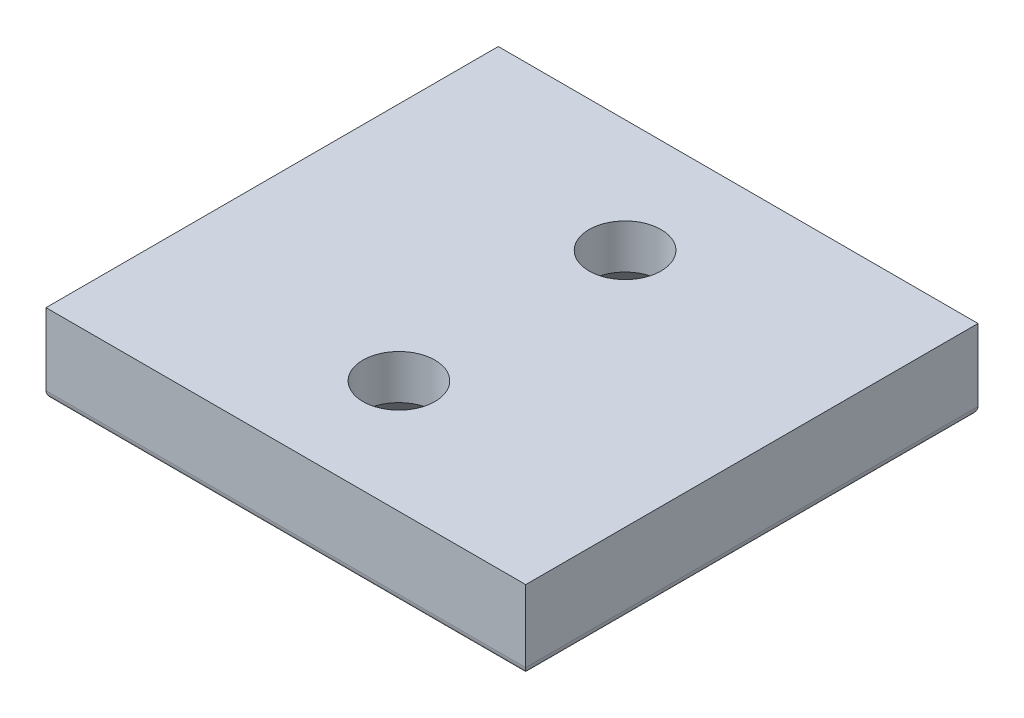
ISO-10303-21;
HEADER;
FILE_DESCRIPTION(('STEP AP214'),'2;1');
FILE_NAME('part.step','',(''),(''),'','','');
FILE_SCHEMA(('AUTOMOTIVE_DESIGN { 1 0 10303 214 1 1 1 1 }'));
ENDSEC;
DATA;
#1=APPLICATION_CONTEXT('core data for automotive mechanical design processes');
#2=APPLICATION_PROTOCOL_DEFINITION('international standard','automotive_design',2000,#1);
#3=PRODUCT_CONTEXT('',#1,'mechanical');
#4=PRODUCT('Part','Part','',(#3));
#5=PRODUCT_RELATED_PRODUCT_CATEGORY('part','',(#4));
#6=PRODUCT_DEFINITION_FORMATION('','',#4);
#7=PRODUCT_DEFINITION_CONTEXT('part definition',#1,'design');
#8=PRODUCT_DEFINITION('design','',#6,#7);
#9=PRODUCT_DEFINITION_SHAPE('','',#8);
#10=(LENGTH_UNIT() NAMED_UNIT(*) SI_UNIT(.MILLI.,.METRE.));
#11=(NAMED_UNIT(*) PLANE_ANGLE_UNIT() SI_UNIT($,.RADIAN.));
#12=(NAMED_UNIT(*) SI_UNIT($,.STERADIAN.) SOLID_ANGLE_UNIT());
#13=UNCERTAINTY_MEASURE_WITH_UNIT(LENGTH_MEASURE(1.E-05),#10,'distance_accuracy_value','');
#14=(GEOMETRIC_REPRESENTATION_CONTEXT(3) GLOBAL_UNCERTAINTY_ASSIGNED_CONTEXT((#13)) GLOBAL_UNIT_ASSIGNED_CONTEXT((#10,
#11,#12)) REPRESENTATION_CONTEXT('',''));
#15=CARTESIAN_POINT('',(0.,0.,0.));
#16=DIRECTION('',(0.,0.,1.));
#17=DIRECTION('',(1.,0.,0.));
#18=AXIS2_PLACEMENT_3D('',#15,#16,#17);
#19=CARTESIAN_POINT('',(30.,10.,28.285));
#20=DIRECTION('',(-1.,0.,0.));
#21=DIRECTION('',(0.,0.,1.));
#22=AXIS2_PLACEMENT_3D('',#19,#20,#21);
#23=PLANE('',#22);
#24=DIRECTION('',(0.,-1.,0.));
#25=VECTOR('',#24,1.);
#26=CARTESIAN_POINT('',(30.,10.,28.285));
#27=LINE('',#26,#25);
#28=CARTESIAN_POINT('',(30.,10.,28.285));
#29=VERTEX_POINT('',#28);
#30=CARTESIAN_POINT('',(30.,0.999999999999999,28.285));
#31=VERTEX_POINT('',#30);
#32=EDGE_CURVE('E153',#29,#31,#27,.T.);
#33=ORIENTED_EDGE('',*,*,#32,.T.);
#34=DIRECTION('',(0.,0.,-1.));
#35=VECTOR('',#34,1.);
#36=CARTESIAN_POINT('',(30.,0.999999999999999,-28.285));
#37=LINE('',#36,#35);
#38=CARTESIAN_POINT('',(30.,0.999999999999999,-28.285));
#39=VERTEX_POINT('',#38);
#40=EDGE_CURVE('E11',#31,#39,#37,.T.);
#41=ORIENTED_EDGE('',*,*,#40,.T.);
#42=DIRECTION('',(0.,-1.,0.));
#43=VECTOR('',#42,1.);
#44=CARTESIAN_POINT('',(30.,10.,-28.285));
#45=LINE('',#44,#43);
#46=CARTESIAN_POINT('',(30.,10.,-28.285));
#47=VERTEX_POINT('',#46);
#48=EDGE_CURVE('E94',#47,#39,#45,.T.);
#49=ORIENTED_EDGE('',*,*,#48,.F.);
#50=DIRECTION('',(0.,0.,-1.));
#51=VECTOR('',#50,1.);
#52=CARTESIAN_POINT('',(30.,10.,28.285));
#53=LINE('',#52,#51);
#54=EDGE_CURVE('E100',#29,#47,#53,.T.);
#55=ORIENTED_EDGE('',*,*,#54,.F.);
#56=EDGE_LOOP('',(#33,#41,#49,#55));
#57=FACE_BOUND('',#56,.T.);
#58=ADVANCED_FACE('F33',(#57),#23,.F.);
#59=CARTESIAN_POINT('',(-30.,10.,-28.285));
#60=DIRECTION('',(0.,0.,1.));
#61=DIRECTION('',(1.,0.,0.));
#62=AXIS2_PLACEMENT_3D('',#59,#60,#61);
#63=PLANE('',#62);
#64=ORIENTED_EDGE('',*,*,#48,.T.);
#65=DIRECTION('',(-1.,0.,0.));
#66=VECTOR('',#65,1.);
#67=CARTESIAN_POINT('',(-30.,0.999999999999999,-28.285));
#68=LINE('',#67,#66);
#69=CARTESIAN_POINT('',(-30.,0.999999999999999,-28.285));
#70=VERTEX_POINT('',#69);
#71=EDGE_CURVE('E109',#39,#70,#68,.T.);
#72=ORIENTED_EDGE('',*,*,#71,.T.);
#73=DIRECTION('',(0.,-1.,0.));
#74=VECTOR('',#73,1.);
#75=CARTESIAN_POINT('',(-30.,10.,-28.285));
#76=LINE('',#75,#74);
#77=CARTESIAN_POINT('',(-30.,10.,-28.285));
#78=VERTEX_POINT('',#77);
#79=EDGE_CURVE('E96',#78,#70,#76,.T.);
#80=ORIENTED_EDGE('',*,*,#79,.F.);
#81=DIRECTION('',(-1.,0.,0.));
#82=VECTOR('',#81,1.);
#83=CARTESIAN_POINT('',(-30.,10.,-28.285));
#84=LINE('',#83,#82);
#85=EDGE_CURVE('E89',#47,#78,#84,.T.);
#86=ORIENTED_EDGE('',*,*,#85,.F.);
#87=EDGE_LOOP('',(#64,#72,#80,#86));
#88=FACE_BOUND('',#87,.T.);
#89=ADVANCED_FACE('F91',(#88),#63,.F.);
#90=CARTESIAN_POINT('',(-30.,10.,28.285));
#91=DIRECTION('',(1.,0.,0.));
#92=DIRECTION('',(0.,0.,-1.));
#93=AXIS2_PLACEMENT_3D('',#90,#91,#92);
#94=PLANE('',#93);
#95=ORIENTED_EDGE('',*,*,#79,.T.);
#96=DIRECTION('',(0.,0.,1.));
#97=VECTOR('',#96,1.);
#98=CARTESIAN_POINT('',(-30.,0.999999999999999,28.285));
#99=LINE('',#98,#97);
#100=CARTESIAN_POINT('',(-30.,0.999999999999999,28.285));
#101=VERTEX_POINT('',#100);
#102=EDGE_CURVE('E57',#70,#101,#99,.T.);
#103=ORIENTED_EDGE('',*,*,#102,.T.);
#104=DIRECTION('',(0.,-1.,0.));
#105=VECTOR('',#104,1.);
#106=CARTESIAN_POINT('',(-30.,10.,28.285));
#107=LINE('',#106,#105);
#108=CARTESIAN_POINT('',(-30.,10.,28.285));
#109=VERTEX_POINT('',#108);
#110=EDGE_CURVE('E113',#109,#101,#107,.T.);
#111=ORIENTED_EDGE('',*,*,#110,.F.);
#112=DIRECTION('',(0.,0.,1.));
#113=VECTOR('',#112,1.);
#114=CARTESIAN_POINT('',(-30.,10.,28.285));
#115=LINE('',#114,#113);
#116=EDGE_CURVE('E99',#78,#109,#115,.T.);
#117=ORIENTED_EDGE('',*,*,#116,.F.);
#118=EDGE_LOOP('',(#95,#103,#111,#117));
#119=FACE_BOUND('',#118,.T.);
#120=ADVANCED_FACE('F151',(#119),#94,.F.);
#121=CARTESIAN_POINT('',(-30.,10.,28.285));
#122=DIRECTION('',(0.,0.,-1.));
#123=DIRECTION('',(-1.,0.,0.));
#124=AXIS2_PLACEMENT_3D('',#121,#122,#123);
#125=PLANE('',#124);
#126=ORIENTED_EDGE('',*,*,#110,.T.);
#127=DIRECTION('',(1.,0.,0.));
#128=VECTOR('',#127,1.);
#129=CARTESIAN_POINT('',(30.,0.999999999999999,28.285));
#130=LINE('',#129,#128);
#131=EDGE_CURVE('E42',#101,#31,#130,.T.);
#132=ORIENTED_EDGE('',*,*,#131,.T.);
#133=ORIENTED_EDGE('',*,*,#32,.F.);
#134=DIRECTION('',(1.,0.,0.));
#135=VECTOR('',#134,1.);
#136=CARTESIAN_POINT('',(-30.,10.,28.285));
#137=LINE('',#136,#135);
#138=EDGE_CURVE('E105',#109,#29,#137,.T.);
#139=ORIENTED_EDGE('',*,*,#138,.F.);
#140=EDGE_LOOP('',(#126,#132,#133,#139));
#141=FACE_BOUND('',#140,.T.);
#142=ADVANCED_FACE('F156',(#141),#125,.F.);
#143=CARTESIAN_POINT('',(0.,10.,0.));
#144=DIRECTION('',(0.,-1.,0.));
#145=DIRECTION('',(0.,0.,-1.));
#146=AXIS2_PLACEMENT_3D('',#143,#144,#145);
#147=PLANE('',#146);
#148=CARTESIAN_POINT('',(0.,10.,14.1425));
#149=DIRECTION('',(0.,-1.,0.));
#150=DIRECTION('',(0.,0.,-1.));
#151=AXIS2_PLACEMENT_3D('',#148,#149,#150);
#152=CIRCLE('',#151,4.5);
#153=CARTESIAN_POINT('',(0.,10.,9.6425));
#154=VERTEX_POINT('',#153);
#155=EDGE_CURVE('E214',#154,#154,#152,.T.);
#156=ORIENTED_EDGE('',*,*,#155,.T.);
#157=EDGE_LOOP('',(#156));
#158=FACE_BOUND('',#157,.T.);
#159=CARTESIAN_POINT('',(0.,10.,-14.1425));
#160=DIRECTION('',(0.,-1.,0.));
#161=DIRECTION('',(0.,0.,-1.));
#162=AXIS2_PLACEMENT_3D('',#159,#160,#161);
#163=CIRCLE('',#162,4.5);
#164=CARTESIAN_POINT('',(0.,10.,-18.6425));
#165=VERTEX_POINT('',#164);
#166=EDGE_CURVE('E130',#165,#165,#163,.T.);
#167=ORIENTED_EDGE('',*,*,#166,.T.);
#168=EDGE_LOOP('',(#167));
#169=FACE_BOUND('',#168,.T.);
#170=ORIENTED_EDGE('',*,*,#54,.T.);
#171=ORIENTED_EDGE('',*,*,#85,.T.);
#172=ORIENTED_EDGE('',*,*,#116,.T.);
#173=ORIENTED_EDGE('',*,*,#138,.T.);
#174=EDGE_LOOP('',(#170,#171,#172,#173));
#175=FACE_BOUND('',#174,.T.);
#176=ADVANCED_FACE('F103',(#158,#169,#175),#147,.F.);
#177=CARTESIAN_POINT('',(0.,0.,0.));
#178=DIRECTION('',(0.,-1.,0.));
#179=DIRECTION('',(0.,0.,-1.));
#180=AXIS2_PLACEMENT_3D('',#177,#178,#179);
#181=PLANE('',#180);
#182=CARTESIAN_POINT('',(0.,0.,14.1425));
#183=DIRECTION('',(0.,-1.,0.));
#184=DIRECTION('',(0.,0.,-1.));
#185=AXIS2_PLACEMENT_3D('',#182,#183,#184);
#186=CIRCLE('',#185,8.96);
#187=CARTESIAN_POINT('',(0.,0.,5.18249999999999));
#188=VERTEX_POINT('',#187);
#189=EDGE_CURVE('E212',#188,#188,#186,.T.);
#190=ORIENTED_EDGE('',*,*,#189,.F.);
#191=EDGE_LOOP('',(#190));
#192=FACE_BOUND('',#191,.T.);
#193=CARTESIAN_POINT('',(0.,0.,-14.1425));
#194=DIRECTION('',(0.,-1.,0.));
#195=DIRECTION('',(0.,0.,-1.));
#196=AXIS2_PLACEMENT_3D('',#193,#194,#195);
#197=CIRCLE('',#196,8.96);
#198=CARTESIAN_POINT('',(0.,0.,-23.1025));
#199=VERTEX_POINT('',#198);
#200=EDGE_CURVE('E219',#199,#199,#197,.T.);
#201=ORIENTED_EDGE('',*,*,#200,.F.);
#202=EDGE_LOOP('',(#201));
#203=FACE_BOUND('',#202,.T.);
#204=DIRECTION('',(0.,0.,1.));
#205=VECTOR('',#204,1.);
#206=CARTESIAN_POINT('',(-29.,0.,-28.285));
#207=LINE('',#206,#205);
#208=CARTESIAN_POINT('',(-29.,0.,27.285));
#209=VERTEX_POINT('',#208);
#210=CARTESIAN_POINT('',(-29.,0.,-27.285));
#211=VERTEX_POINT('',#210);
#212=EDGE_CURVE('E120',#209,#211,#207,.F.);
#213=ORIENTED_EDGE('',*,*,#212,.T.);
#214=DIRECTION('',(-1.,0.,0.));
#215=VECTOR('',#214,1.);
#216=CARTESIAN_POINT('',(30.,0.,-27.285));
#217=LINE('',#216,#215);
#218=CARTESIAN_POINT('',(29.,0.,-27.285));
#219=VERTEX_POINT('',#218);
#220=EDGE_CURVE('E122',#211,#219,#217,.F.);
#221=ORIENTED_EDGE('',*,*,#220,.T.);
#222=DIRECTION('',(0.,0.,-1.));
#223=VECTOR('',#222,1.);
#224=CARTESIAN_POINT('',(29.,0.,28.285));
#225=LINE('',#224,#223);
#226=CARTESIAN_POINT('',(29.,0.,27.285));
#227=VERTEX_POINT('',#226);
#228=EDGE_CURVE('E111',#219,#227,#225,.F.);
#229=ORIENTED_EDGE('',*,*,#228,.T.);
#230=DIRECTION('',(1.,0.,0.));
#231=VECTOR('',#230,1.);
#232=CARTESIAN_POINT('',(-30.,0.,27.285));
#233=LINE('',#232,#231);
#234=EDGE_CURVE('E118',#227,#209,#233,.F.);
#235=ORIENTED_EDGE('',*,*,#234,.T.);
#236=EDGE_LOOP('',(#213,#221,#229,#235));
#237=FACE_BOUND('',#236,.T.);
#238=ADVANCED_FACE('F144',(#192,#203,#237),#181,.T.);
#239=CARTESIAN_POINT('',(-30.,0.999999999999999,27.285));
#240=DIRECTION('',(-1.,0.,0.));
#241=DIRECTION('',(0.,0.,1.));
#242=AXIS2_PLACEMENT_3D('',#239,#240,#241);
#243=CYLINDRICAL_SURFACE('',#242,1.);
#244=CARTESIAN_POINT('',(-29.,0.999999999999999,27.285));
#245=DIRECTION('',(-0.707106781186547,0.,-0.707106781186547));
#246=DIRECTION('',(-0.707106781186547,0.,0.707106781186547));
#247=AXIS2_PLACEMENT_3D('',#244,#245,#246);
#248=ELLIPSE('',#247,1.41421356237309,1.);
#249=EDGE_CURVE('E131',#209,#101,#248,.T.);
#250=ORIENTED_EDGE('',*,*,#249,.F.);
#251=ORIENTED_EDGE('',*,*,#234,.F.);
#252=CARTESIAN_POINT('',(29.,0.999999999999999,27.285));
#253=DIRECTION('',(-0.707106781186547,0.,0.707106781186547));
#254=DIRECTION('',(0.707106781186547,0.,0.707106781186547));
#255=AXIS2_PLACEMENT_3D('',#252,#253,#254);
#256=ELLIPSE('',#255,1.41421356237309,1.);
#257=EDGE_CURVE('E37',#31,#227,#256,.F.);
#258=ORIENTED_EDGE('',*,*,#257,.F.);
#259=ORIENTED_EDGE('',*,*,#131,.F.);
#260=EDGE_LOOP('',(#250,#251,#258,#259));
#261=FACE_BOUND('',#260,.T.);
#262=ADVANCED_FACE('F35',(#261),#243,.T.);
#263=CARTESIAN_POINT('',(29.,0.999999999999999,28.285));
#264=DIRECTION('',(0.,0.,1.));
#265=DIRECTION('',(1.,0.,0.));
#266=AXIS2_PLACEMENT_3D('',#263,#264,#265);
#267=CYLINDRICAL_SURFACE('',#266,1.);
#268=ORIENTED_EDGE('',*,*,#257,.T.);
#269=ORIENTED_EDGE('',*,*,#228,.F.);
#270=CARTESIAN_POINT('',(29.,0.999999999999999,-27.285));
#271=DIRECTION('',(0.707106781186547,0.,0.707106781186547));
#272=DIRECTION('',(-0.707106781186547,0.,0.707106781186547));
#273=AXIS2_PLACEMENT_3D('',#270,#271,#272);
#274=ELLIPSE('',#273,1.41421356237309,1.);
#275=EDGE_CURVE('E129',#39,#219,#274,.F.);
#276=ORIENTED_EDGE('',*,*,#275,.F.);
#277=ORIENTED_EDGE('',*,*,#40,.F.);
#278=EDGE_LOOP('',(#268,#269,#276,#277));
#279=FACE_BOUND('',#278,.T.);
#280=ADVANCED_FACE('F140',(#279),#267,.T.);
#281=CARTESIAN_POINT('',(-29.,0.999999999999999,28.285));
#282=DIRECTION('',(0.,0.,-1.));
#283=DIRECTION('',(-1.,0.,0.));
#284=AXIS2_PLACEMENT_3D('',#281,#282,#283);
#285=CYLINDRICAL_SURFACE('',#284,1.);
#286=ORIENTED_EDGE('',*,*,#249,.T.);
#287=ORIENTED_EDGE('',*,*,#102,.F.);
#288=CARTESIAN_POINT('',(-29.,0.999999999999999,-27.285));
#289=DIRECTION('',(0.707106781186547,0.,-0.707106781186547));
#290=DIRECTION('',(-0.707106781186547,0.,-0.707106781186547));
#291=AXIS2_PLACEMENT_3D('',#288,#289,#290);
#292=ELLIPSE('',#291,1.41421356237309,1.);
#293=EDGE_CURVE('E127',#211,#70,#292,.T.);
#294=ORIENTED_EDGE('',*,*,#293,.F.);
#295=ORIENTED_EDGE('',*,*,#212,.F.);
#296=EDGE_LOOP('',(#286,#287,#294,#295));
#297=FACE_BOUND('',#296,.T.);
#298=ADVANCED_FACE('F150',(#297),#285,.T.);
#299=CARTESIAN_POINT('',(-30.,0.999999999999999,-27.285));
#300=DIRECTION('',(1.,0.,0.));
#301=DIRECTION('',(0.,0.,-1.));
#302=AXIS2_PLACEMENT_3D('',#299,#300,#301);
#303=CYLINDRICAL_SURFACE('',#302,1.);
#304=ORIENTED_EDGE('',*,*,#275,.T.);
#305=ORIENTED_EDGE('',*,*,#220,.F.);
#306=ORIENTED_EDGE('',*,*,#293,.T.);
#307=ORIENTED_EDGE('',*,*,#71,.F.);
#308=EDGE_LOOP('',(#304,#305,#306,#307));
#309=FACE_BOUND('',#308,.T.);
#310=ADVANCED_FACE('F148',(#309),#303,.T.);
#311=CARTESIAN_POINT('',(0.,0.,-14.1425));
#312=DIRECTION('',(0.,-1.,0.));
#313=DIRECTION('',(0.,0.,-1.));
#314=AXIS2_PLACEMENT_3D('',#311,#312,#313);
#315=CYLINDRICAL_SURFACE('',#314,4.49999999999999);
#316=ORIENTED_EDGE('',*,*,#166,.F.);
#317=EDGE_LOOP('',(#316));
#318=FACE_BOUND('',#317,.T.);
#319=CARTESIAN_POINT('',(0.,4.45999999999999,-14.1425));
#320=DIRECTION('',(0.,-1.,0.));
#321=DIRECTION('',(0.,0.,-1.));
#322=AXIS2_PLACEMENT_3D('',#319,#320,#321);
#323=CIRCLE('',#322,4.49999999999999);
#324=CARTESIAN_POINT('',(0.,4.45999999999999,-18.6425));
#325=VERTEX_POINT('',#324);
#326=EDGE_CURVE('E222',#325,#325,#323,.T.);
#327=ORIENTED_EDGE('',*,*,#326,.T.);
#328=EDGE_LOOP('',(#327));
#329=FACE_BOUND('',#328,.T.);
#330=ADVANCED_FACE('F176',(#318,#329),#315,.F.);
#331=CARTESIAN_POINT('',(0.,0.,-14.1425));
#332=DIRECTION('',(0.,-1.,0.));
#333=DIRECTION('',(0.,0.,-1.));
#334=AXIS2_PLACEMENT_3D('',#331,#332,#333);
#335=CONICAL_SURFACE('',#334,8.96,0.78539816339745);
#336=ORIENTED_EDGE('',*,*,#326,.F.);
#337=EDGE_LOOP('',(#336));
#338=FACE_BOUND('',#337,.T.);
#339=ORIENTED_EDGE('',*,*,#200,.T.);
#340=EDGE_LOOP('',(#339));
#341=FACE_BOUND('',#340,.T.);
#342=ADVANCED_FACE('F193',(#338,#341),#335,.F.);
#343=CARTESIAN_POINT('',(0.,0.,14.1425));
#344=DIRECTION('',(0.,-1.,0.));
#345=DIRECTION('',(0.,0.,-1.));
#346=AXIS2_PLACEMENT_3D('',#343,#344,#345);
#347=CYLINDRICAL_SURFACE('',#346,4.49999999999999);
#348=ORIENTED_EDGE('',*,*,#155,.F.);
#349=EDGE_LOOP('',(#348));
#350=FACE_BOUND('',#349,.T.);
#351=CARTESIAN_POINT('',(0.,4.45999999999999,14.1425));
#352=DIRECTION('',(0.,-1.,0.));
#353=DIRECTION('',(0.,0.,-1.));
#354=AXIS2_PLACEMENT_3D('',#351,#352,#353);
#355=CIRCLE('',#354,4.49999999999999);
#356=CARTESIAN_POINT('',(0.,4.45999999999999,9.64250000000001));
#357=VERTEX_POINT('',#356);
#358=EDGE_CURVE('E210',#357,#357,#355,.T.);
#359=ORIENTED_EDGE('',*,*,#358,.T.);
#360=EDGE_LOOP('',(#359));
#361=FACE_BOUND('',#360,.T.);
#362=ADVANCED_FACE('F197',(#350,#361),#347,.F.);
#363=CARTESIAN_POINT('',(0.,0.,14.1425));
#364=DIRECTION('',(0.,-1.,0.));
#365=DIRECTION('',(0.,0.,-1.));
#366=AXIS2_PLACEMENT_3D('',#363,#364,#365);
#367=CONICAL_SURFACE('',#366,8.96,0.78539816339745);
#368=ORIENTED_EDGE('',*,*,#358,.F.);
#369=EDGE_LOOP('',(#368));
#370=FACE_BOUND('',#369,.T.);
#371=ORIENTED_EDGE('',*,*,#189,.T.);
#372=EDGE_LOOP('',(#371));
#373=FACE_BOUND('',#372,.T.);
#374=ADVANCED_FACE('F201',(#370,#373),#367,.F.);
#375=CLOSED_SHELL('',(#58,#89,#120,#142,#176,#238,#262,#280,#298,#310,#330,#342,#362,#374));
#376=MANIFOLD_SOLID_BREP('B2',#375);
#377=ADVANCED_BREP_SHAPE_REPRESENTATION('',(#18,#376),#14);
#378=SHAPE_DEFINITION_REPRESENTATION(#9,#377);
ENDSEC;
END-ISO-10303-21;
